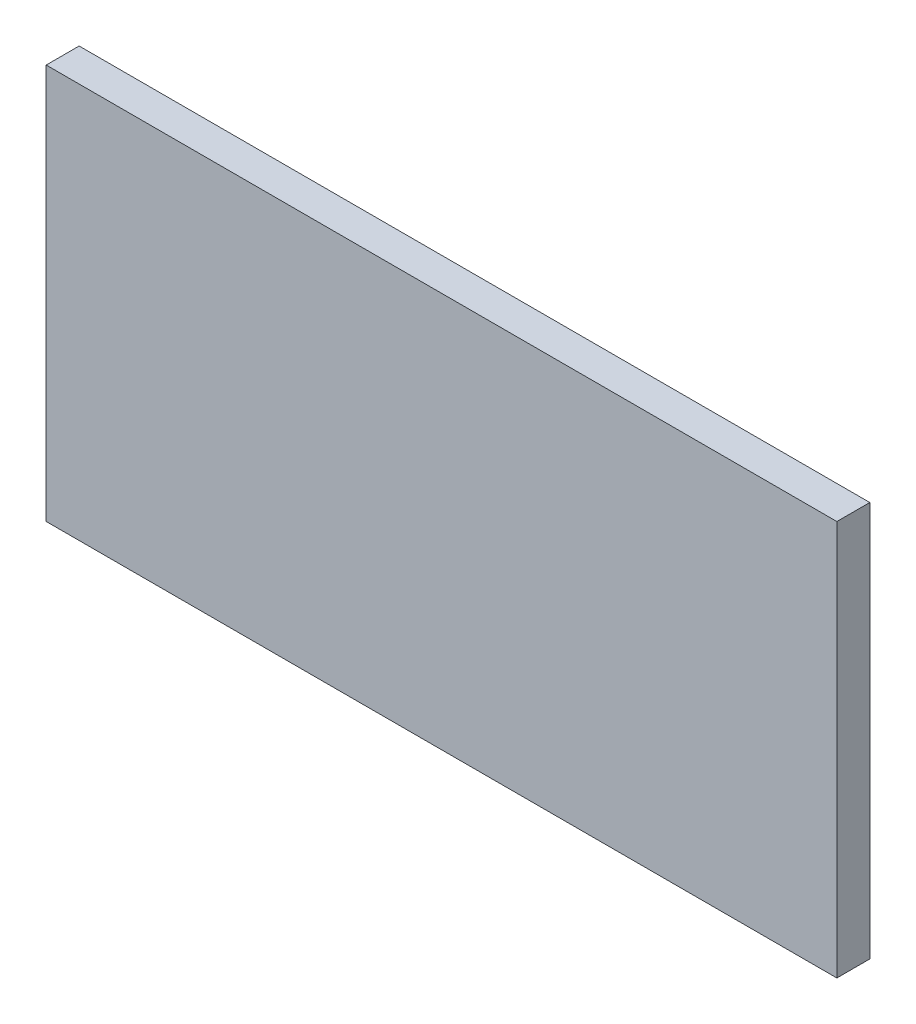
from build123d import *

# Parameters (mm, degrees)
ESQUISSE1_W          = 120
ESQUISSE1_H          = 60
BASE_EXTRUSION_DEPTH = 5


with BuildPart() as part:
    # Esquisse1 → Base-Extrusion (new body)
    with BuildSketch(Plane.XY):
        with Locations((60, -30)):
            Rectangle(ESQUISSE1_W, ESQUISSE1_H)
    extrude(amount=BASE_EXTRUSION_DEPTH)


solid = part.part
